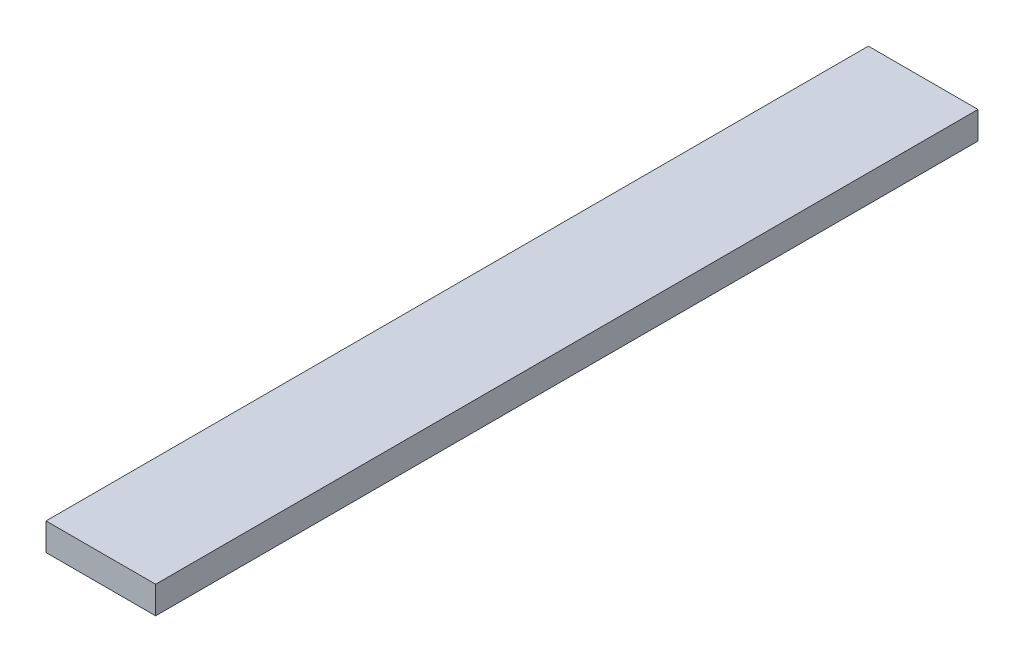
ISO-10303-21;
HEADER;
FILE_DESCRIPTION(('STEP AP214'),'2;1');
FILE_NAME('part.step','',(''),(''),'','','');
FILE_SCHEMA(('AUTOMOTIVE_DESIGN { 1 0 10303 214 1 1 1 1 }'));
ENDSEC;
DATA;
#1=APPLICATION_CONTEXT('core data for automotive mechanical design processes');
#2=APPLICATION_PROTOCOL_DEFINITION('international standard','automotive_design',2000,#1);
#3=PRODUCT_CONTEXT('',#1,'mechanical');
#4=PRODUCT('Part','Part','',(#3));
#5=PRODUCT_RELATED_PRODUCT_CATEGORY('part','',(#4));
#6=PRODUCT_DEFINITION_FORMATION('','',#4);
#7=PRODUCT_DEFINITION_CONTEXT('part definition',#1,'design');
#8=PRODUCT_DEFINITION('design','',#6,#7);
#9=PRODUCT_DEFINITION_SHAPE('','',#8);
#10=(LENGTH_UNIT() NAMED_UNIT(*) SI_UNIT(.MILLI.,.METRE.));
#11=(NAMED_UNIT(*) PLANE_ANGLE_UNIT() SI_UNIT($,.RADIAN.));
#12=(NAMED_UNIT(*) SI_UNIT($,.STERADIAN.) SOLID_ANGLE_UNIT());
#13=UNCERTAINTY_MEASURE_WITH_UNIT(LENGTH_MEASURE(1.E-05),#10,'distance_accuracy_value','');
#14=(GEOMETRIC_REPRESENTATION_CONTEXT(3) GLOBAL_UNCERTAINTY_ASSIGNED_CONTEXT((#13)) GLOBAL_UNIT_ASSIGNED_CONTEXT((#10,
#11,#12)) REPRESENTATION_CONTEXT('',''));
#15=CARTESIAN_POINT('',(0.,0.,0.));
#16=DIRECTION('',(0.,0.,1.));
#17=DIRECTION('',(1.,0.,0.));
#18=AXIS2_PLACEMENT_3D('',#15,#16,#17);
#19=CARTESIAN_POINT('',(25.4,-6.35,381.));
#20=DIRECTION('',(-1.,0.,0.));
#21=DIRECTION('',(0.,0.,1.));
#22=AXIS2_PLACEMENT_3D('',#19,#20,#21);
#23=PLANE('',#22);
#24=DIRECTION('',(0.,1.,0.));
#25=VECTOR('',#24,1.);
#26=CARTESIAN_POINT('',(25.4,-6.35,0.));
#27=LINE('',#26,#25);
#28=CARTESIAN_POINT('',(25.4,-6.35,0.));
#29=VERTEX_POINT('',#28);
#30=CARTESIAN_POINT('',(25.4,6.35,0.));
#31=VERTEX_POINT('',#30);
#32=EDGE_CURVE('E113',#29,#31,#27,.T.);
#33=ORIENTED_EDGE('',*,*,#32,.T.);
#34=DIRECTION('',(0.,0.,-1.));
#35=VECTOR('',#34,1.);
#36=CARTESIAN_POINT('',(25.4,6.35,381.));
#37=LINE('',#36,#35);
#38=CARTESIAN_POINT('',(25.4,6.35,381.));
#39=VERTEX_POINT('',#38);
#40=EDGE_CURVE('E11',#39,#31,#37,.T.);
#41=ORIENTED_EDGE('',*,*,#40,.F.);
#42=DIRECTION('',(0.,1.,0.));
#43=VECTOR('',#42,1.);
#44=CARTESIAN_POINT('',(25.4,-6.35,381.));
#45=LINE('',#44,#43);
#46=CARTESIAN_POINT('',(25.4,-6.35,381.));
#47=VERTEX_POINT('',#46);
#48=EDGE_CURVE('E97',#47,#39,#45,.T.);
#49=ORIENTED_EDGE('',*,*,#48,.F.);
#50=DIRECTION('',(0.,0.,-1.));
#51=VECTOR('',#50,1.);
#52=CARTESIAN_POINT('',(25.4,-6.35,381.));
#53=LINE('',#52,#51);
#54=EDGE_CURVE('E109',#47,#29,#53,.T.);
#55=ORIENTED_EDGE('',*,*,#54,.T.);
#56=EDGE_LOOP('',(#33,#41,#49,#55));
#57=FACE_BOUND('',#56,.T.);
#58=ADVANCED_FACE('F45',(#57),#23,.F.);
#59=CARTESIAN_POINT('',(-25.4,6.35,381.));
#60=DIRECTION('',(0.,-1.,0.));
#61=DIRECTION('',(0.,0.,-1.));
#62=AXIS2_PLACEMENT_3D('',#59,#60,#61);
#63=PLANE('',#62);
#64=DIRECTION('',(-1.,0.,0.));
#65=VECTOR('',#64,1.);
#66=CARTESIAN_POINT('',(-25.4,6.35,0.));
#67=LINE('',#66,#65);
#68=CARTESIAN_POINT('',(-25.4,6.35,0.));
#69=VERTEX_POINT('',#68);
#70=EDGE_CURVE('E102',#31,#69,#67,.T.);
#71=ORIENTED_EDGE('',*,*,#70,.T.);
#72=DIRECTION('',(0.,0.,-1.));
#73=VECTOR('',#72,1.);
#74=CARTESIAN_POINT('',(-25.4,6.35,381.));
#75=LINE('',#74,#73);
#76=CARTESIAN_POINT('',(-25.4,6.35,381.));
#77=VERTEX_POINT('',#76);
#78=EDGE_CURVE('E54',#77,#69,#75,.T.);
#79=ORIENTED_EDGE('',*,*,#78,.F.);
#80=DIRECTION('',(-1.,0.,0.));
#81=VECTOR('',#80,1.);
#82=CARTESIAN_POINT('',(-25.4,6.35,381.));
#83=LINE('',#82,#81);
#84=EDGE_CURVE('E92',#39,#77,#83,.T.);
#85=ORIENTED_EDGE('',*,*,#84,.F.);
#86=ORIENTED_EDGE('',*,*,#40,.T.);
#87=EDGE_LOOP('',(#71,#79,#85,#86));
#88=FACE_BOUND('',#87,.T.);
#89=ADVANCED_FACE('F101',(#88),#63,.F.);
#90=CARTESIAN_POINT('',(-25.4,-6.35,381.));
#91=DIRECTION('',(1.,0.,0.));
#92=DIRECTION('',(0.,0.,-1.));
#93=AXIS2_PLACEMENT_3D('',#90,#91,#92);
#94=PLANE('',#93);
#95=DIRECTION('',(0.,-1.,0.));
#96=VECTOR('',#95,1.);
#97=CARTESIAN_POINT('',(-25.4,-6.35,0.));
#98=LINE('',#97,#96);
#99=CARTESIAN_POINT('',(-25.4,-6.35,0.));
#100=VERTEX_POINT('',#99);
#101=EDGE_CURVE('E79',#69,#100,#98,.T.);
#102=ORIENTED_EDGE('',*,*,#101,.T.);
#103=DIRECTION('',(0.,0.,-1.));
#104=VECTOR('',#103,1.);
#105=CARTESIAN_POINT('',(-25.4,-6.35,381.));
#106=LINE('',#105,#104);
#107=CARTESIAN_POINT('',(-25.4,-6.35,381.));
#108=VERTEX_POINT('',#107);
#109=EDGE_CURVE('E104',#108,#100,#106,.T.);
#110=ORIENTED_EDGE('',*,*,#109,.F.);
#111=DIRECTION('',(0.,-1.,0.));
#112=VECTOR('',#111,1.);
#113=CARTESIAN_POINT('',(-25.4,-6.35,381.));
#114=LINE('',#113,#112);
#115=EDGE_CURVE('E95',#77,#108,#114,.T.);
#116=ORIENTED_EDGE('',*,*,#115,.F.);
#117=ORIENTED_EDGE('',*,*,#78,.T.);
#118=EDGE_LOOP('',(#102,#110,#116,#117));
#119=FACE_BOUND('',#118,.T.);
#120=ADVANCED_FACE('F105',(#119),#94,.F.);
#121=CARTESIAN_POINT('',(-25.4,-6.35,381.));
#122=DIRECTION('',(0.,1.,0.));
#123=DIRECTION('',(0.,0.,1.));
#124=AXIS2_PLACEMENT_3D('',#121,#122,#123);
#125=PLANE('',#124);
#126=DIRECTION('',(1.,0.,0.));
#127=VECTOR('',#126,1.);
#128=CARTESIAN_POINT('',(-25.4,-6.35,0.));
#129=LINE('',#128,#127);
#130=EDGE_CURVE('E85',#100,#29,#129,.T.);
#131=ORIENTED_EDGE('',*,*,#130,.T.);
#132=ORIENTED_EDGE('',*,*,#54,.F.);
#133=DIRECTION('',(1.,0.,0.));
#134=VECTOR('',#133,1.);
#135=CARTESIAN_POINT('',(-25.4,-6.35,381.));
#136=LINE('',#135,#134);
#137=EDGE_CURVE('E62',#108,#47,#136,.T.);
#138=ORIENTED_EDGE('',*,*,#137,.F.);
#139=ORIENTED_EDGE('',*,*,#109,.T.);
#140=EDGE_LOOP('',(#131,#132,#138,#139));
#141=FACE_BOUND('',#140,.T.);
#142=ADVANCED_FACE('F126',(#141),#125,.F.);
#143=CARTESIAN_POINT('',(0.,0.,381.));
#144=DIRECTION('',(0.,0.,-1.));
#145=DIRECTION('',(-1.,0.,0.));
#146=AXIS2_PLACEMENT_3D('',#143,#144,#145);
#147=PLANE('',#146);
#148=ORIENTED_EDGE('',*,*,#48,.T.);
#149=ORIENTED_EDGE('',*,*,#84,.T.);
#150=ORIENTED_EDGE('',*,*,#115,.T.);
#151=ORIENTED_EDGE('',*,*,#137,.T.);
#152=EDGE_LOOP('',(#148,#149,#150,#151));
#153=FACE_BOUND('',#152,.T.);
#154=ADVANCED_FACE('F93',(#153),#147,.F.);
#155=CARTESIAN_POINT('',(0.,0.,0.));
#156=DIRECTION('',(0.,0.,-1.));
#157=DIRECTION('',(-1.,0.,0.));
#158=AXIS2_PLACEMENT_3D('',#155,#156,#157);
#159=PLANE('',#158);
#160=ORIENTED_EDGE('',*,*,#32,.F.);
#161=ORIENTED_EDGE('',*,*,#130,.F.);
#162=ORIENTED_EDGE('',*,*,#101,.F.);
#163=ORIENTED_EDGE('',*,*,#70,.F.);
#164=EDGE_LOOP('',(#160,#161,#162,#163));
#165=FACE_BOUND('',#164,.T.);
#166=ADVANCED_FACE('F129',(#165),#159,.T.);
#167=CLOSED_SHELL('',(#58,#89,#120,#142,#154,#166));
#168=MANIFOLD_SOLID_BREP('B2',#167);
#169=ADVANCED_BREP_SHAPE_REPRESENTATION('',(#18,#168),#14);
#170=SHAPE_DEFINITION_REPRESENTATION(#9,#169);
ENDSEC;
END-ISO-10303-21;
